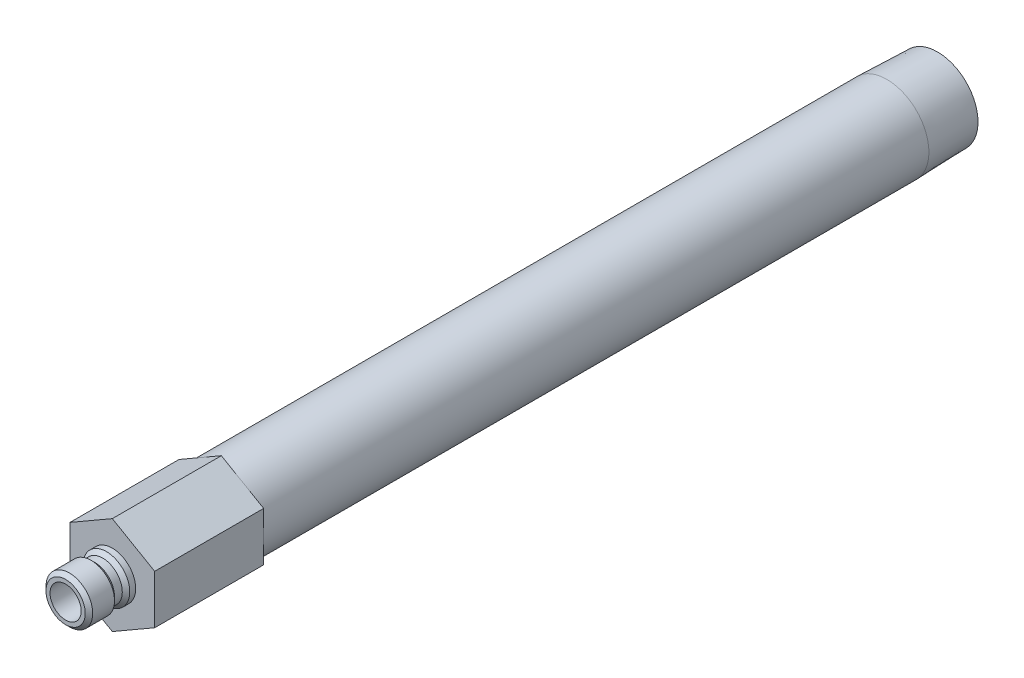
from build123d import *

# Parameters (mm, degrees)
SKETCH2_R           = 3.175
BOSS_EXTRUDE1_DEPTH = 22.225


with BuildPart() as part:
    # Sketch1 → Revolve1 (revolve)
    with BuildSketch(Plane(origin=(0, 0, 0), x_dir=(0, 0, -1), z_dir=(1, 0, 0))):
        Polygon((-9.525, 3.175), (-9.525, 4.0005), (-8.763, 4.7625), (-4.318, 4.7625), (-3.556, 4.0005), (-1.9685, 4.0005), (-1.2065, 4.7625), (0, 4.7625), (0, 8.5725), (157.9372, 8.5725), (168.275, 8.249445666), (168.275, 6.2611), (22.225, 6.2611), (22.225, 3.175), align=None)
    revolve(axis=Axis((0, 0, 0), (0, 0, 1)))

    # Sketch2 → Boss-Extrude1 (add)
    with BuildSketch(Plane.XY):
        Polygon((-8.636, 4.985996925), (-8.636, -4.985996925), (0, -9.971993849), (8.636, -4.985996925), (8.636, 4.985996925), (0, 9.971993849), align=None)
        with Locations(Location((0, 0, 0), (0, 0, 90))):
            Circle(SKETCH2_R, mode=Mode.SUBTRACT)
    extrude(amount=-BOSS_EXTRUDE1_DEPTH)


solid = part.part
